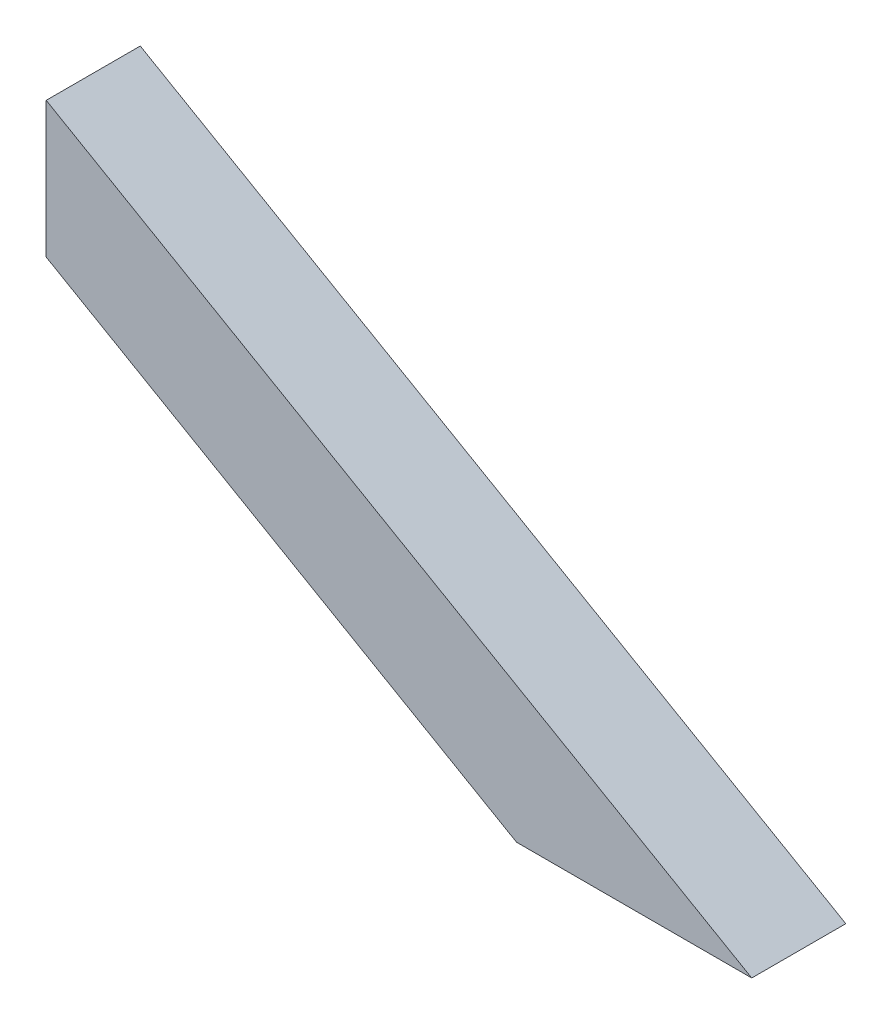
ISO-10303-21;
HEADER;
FILE_DESCRIPTION(('STEP AP214'),'2;1');
FILE_NAME('part.step','',(''),(''),'','','');
FILE_SCHEMA(('AUTOMOTIVE_DESIGN { 1 0 10303 214 1 1 1 1 }'));
ENDSEC;
DATA;
#1=APPLICATION_CONTEXT('core data for automotive mechanical design processes');
#2=APPLICATION_PROTOCOL_DEFINITION('international standard','automotive_design',2000,#1);
#3=PRODUCT_CONTEXT('',#1,'mechanical');
#4=PRODUCT('Part','Part','',(#3));
#5=PRODUCT_RELATED_PRODUCT_CATEGORY('part','',(#4));
#6=PRODUCT_DEFINITION_FORMATION('','',#4);
#7=PRODUCT_DEFINITION_CONTEXT('part definition',#1,'design');
#8=PRODUCT_DEFINITION('design','',#6,#7);
#9=PRODUCT_DEFINITION_SHAPE('','',#8);
#10=(LENGTH_UNIT() NAMED_UNIT(*) SI_UNIT(.MILLI.,.METRE.));
#11=(NAMED_UNIT(*) PLANE_ANGLE_UNIT() SI_UNIT($,.RADIAN.));
#12=(NAMED_UNIT(*) SI_UNIT($,.STERADIAN.) SOLID_ANGLE_UNIT());
#13=UNCERTAINTY_MEASURE_WITH_UNIT(LENGTH_MEASURE(1.E-05),#10,'distance_accuracy_value','');
#14=(GEOMETRIC_REPRESENTATION_CONTEXT(3) GLOBAL_UNCERTAINTY_ASSIGNED_CONTEXT((#13)) GLOBAL_UNIT_ASSIGNED_CONTEXT((#10,
#11,#12)) REPRESENTATION_CONTEXT('',''));
#15=CARTESIAN_POINT('',(0.,0.,0.));
#16=DIRECTION('',(0.,0.,1.));
#17=DIRECTION('',(1.,0.,0.));
#18=AXIS2_PLACEMENT_3D('',#15,#16,#17);
#19=CARTESIAN_POINT('',(100.,0.,20.));
#20=DIRECTION('',(0.500000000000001,0.866025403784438,0.));
#21=DIRECTION('',(-0.866025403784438,0.500000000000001,0.));
#22=AXIS2_PLACEMENT_3D('',#19,#20,#21);
#23=PLANE('',#22);
#24=DIRECTION('',(0.866025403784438,-0.500000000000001,0.));
#25=VECTOR('',#24,1.);
#26=CARTESIAN_POINT('',(100.,0.,0.));
#27=LINE('',#26,#25);
#28=CARTESIAN_POINT('',(0.,57.7350269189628,0.));
#29=VERTEX_POINT('',#28);
#30=CARTESIAN_POINT('',(100.,0.,0.));
#31=VERTEX_POINT('',#30);
#32=EDGE_CURVE('E101',#29,#31,#27,.T.);
#33=ORIENTED_EDGE('',*,*,#32,.T.);
#34=DIRECTION('',(0.,0.,-1.));
#35=VECTOR('',#34,1.);
#36=CARTESIAN_POINT('',(100.,0.,20.));
#37=LINE('',#36,#35);
#38=CARTESIAN_POINT('',(100.,0.,20.));
#39=VERTEX_POINT('',#38);
#40=EDGE_CURVE('E11',#39,#31,#37,.T.);
#41=ORIENTED_EDGE('',*,*,#40,.F.);
#42=DIRECTION('',(0.866025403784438,-0.500000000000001,0.));
#43=VECTOR('',#42,1.);
#44=CARTESIAN_POINT('',(100.,0.,20.));
#45=LINE('',#44,#43);
#46=CARTESIAN_POINT('',(0.,57.7350269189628,20.));
#47=VERTEX_POINT('',#46);
#48=EDGE_CURVE('E89',#47,#39,#45,.T.);
#49=ORIENTED_EDGE('',*,*,#48,.F.);
#50=DIRECTION('',(0.,0.,-1.));
#51=VECTOR('',#50,1.);
#52=CARTESIAN_POINT('',(0.,57.7350269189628,20.));
#53=LINE('',#52,#51);
#54=EDGE_CURVE('E97',#47,#29,#53,.T.);
#55=ORIENTED_EDGE('',*,*,#54,.T.);
#56=EDGE_LOOP('',(#33,#41,#49,#55));
#57=FACE_BOUND('',#56,.T.);
#58=ADVANCED_FACE('F38',(#57),#23,.F.);
#59=CARTESIAN_POINT('',(150.,0.,20.));
#60=DIRECTION('',(0.,1.,0.));
#61=DIRECTION('',(-1.,0.,0.));
#62=AXIS2_PLACEMENT_3D('',#59,#60,#61);
#63=PLANE('',#62);
#64=DIRECTION('',(1.,0.,0.));
#65=VECTOR('',#64,1.);
#66=CARTESIAN_POINT('',(150.,0.,0.));
#67=LINE('',#66,#65);
#68=CARTESIAN_POINT('',(150.,0.,0.));
#69=VERTEX_POINT('',#68);
#70=EDGE_CURVE('E93',#31,#69,#67,.T.);
#71=ORIENTED_EDGE('',*,*,#70,.T.);
#72=DIRECTION('',(0.,0.,-1.));
#73=VECTOR('',#72,1.);
#74=CARTESIAN_POINT('',(150.,0.,20.));
#75=LINE('',#74,#73);
#76=CARTESIAN_POINT('',(150.,0.,20.));
#77=VERTEX_POINT('',#76);
#78=EDGE_CURVE('E46',#77,#69,#75,.T.);
#79=ORIENTED_EDGE('',*,*,#78,.F.);
#80=DIRECTION('',(1.,0.,0.));
#81=VECTOR('',#80,1.);
#82=CARTESIAN_POINT('',(150.,0.,20.));
#83=LINE('',#82,#81);
#84=EDGE_CURVE('E84',#39,#77,#83,.T.);
#85=ORIENTED_EDGE('',*,*,#84,.F.);
#86=ORIENTED_EDGE('',*,*,#40,.T.);
#87=EDGE_LOOP('',(#71,#79,#85,#86));
#88=FACE_BOUND('',#87,.T.);
#89=ADVANCED_FACE('F92',(#88),#63,.F.);
#90=CARTESIAN_POINT('',(0.,86.602540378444,20.));
#91=DIRECTION('',(-0.500000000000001,-0.866025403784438,0.));
#92=DIRECTION('',(0.866025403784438,-0.500000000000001,0.));
#93=AXIS2_PLACEMENT_3D('',#90,#91,#92);
#94=PLANE('',#93);
#95=DIRECTION('',(-0.866025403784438,0.500000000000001,0.));
#96=VECTOR('',#95,1.);
#97=CARTESIAN_POINT('',(0.,86.602540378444,0.));
#98=LINE('',#97,#96);
#99=CARTESIAN_POINT('',(0.,86.602540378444,0.));
#100=VERTEX_POINT('',#99);
#101=EDGE_CURVE('E71',#69,#100,#98,.T.);
#102=ORIENTED_EDGE('',*,*,#101,.T.);
#103=DIRECTION('',(0.,0.,-1.));
#104=VECTOR('',#103,1.);
#105=CARTESIAN_POINT('',(0.,86.602540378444,20.));
#106=LINE('',#105,#104);
#107=CARTESIAN_POINT('',(0.,86.602540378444,20.));
#108=VERTEX_POINT('',#107);
#109=EDGE_CURVE('E94',#108,#100,#106,.T.);
#110=ORIENTED_EDGE('',*,*,#109,.F.);
#111=DIRECTION('',(-0.866025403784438,0.500000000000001,0.));
#112=VECTOR('',#111,1.);
#113=CARTESIAN_POINT('',(0.,86.602540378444,20.));
#114=LINE('',#113,#112);
#115=EDGE_CURVE('E87',#77,#108,#114,.T.);
#116=ORIENTED_EDGE('',*,*,#115,.F.);
#117=ORIENTED_EDGE('',*,*,#78,.T.);
#118=EDGE_LOOP('',(#102,#110,#116,#117));
#119=FACE_BOUND('',#118,.T.);
#120=ADVANCED_FACE('F95',(#119),#94,.F.);
#121=CARTESIAN_POINT('',(0.,57.7350269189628,20.));
#122=DIRECTION('',(1.,0.,0.));
#123=DIRECTION('',(0.,1.,0.));
#124=AXIS2_PLACEMENT_3D('',#121,#122,#123);
#125=PLANE('',#124);
#126=DIRECTION('',(0.,-1.,0.));
#127=VECTOR('',#126,1.);
#128=CARTESIAN_POINT('',(0.,57.7350269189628,0.));
#129=LINE('',#128,#127);
#130=EDGE_CURVE('E77',#100,#29,#129,.T.);
#131=ORIENTED_EDGE('',*,*,#130,.T.);
#132=ORIENTED_EDGE('',*,*,#54,.F.);
#133=DIRECTION('',(0.,-1.,0.));
#134=VECTOR('',#133,1.);
#135=CARTESIAN_POINT('',(0.,57.7350269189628,20.));
#136=LINE('',#135,#134);
#137=EDGE_CURVE('E54',#108,#47,#136,.T.);
#138=ORIENTED_EDGE('',*,*,#137,.F.);
#139=ORIENTED_EDGE('',*,*,#109,.T.);
#140=EDGE_LOOP('',(#131,#132,#138,#139));
#141=FACE_BOUND('',#140,.T.);
#142=ADVANCED_FACE('F108',(#141),#125,.F.);
#143=CARTESIAN_POINT('',(0.,57.7350269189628,20.));
#144=DIRECTION('',(0.,0.,-1.));
#145=DIRECTION('',(-1.,0.,0.));
#146=AXIS2_PLACEMENT_3D('',#143,#144,#145);
#147=PLANE('',#146);
#148=ORIENTED_EDGE('',*,*,#48,.T.);
#149=ORIENTED_EDGE('',*,*,#84,.T.);
#150=ORIENTED_EDGE('',*,*,#115,.T.);
#151=ORIENTED_EDGE('',*,*,#137,.T.);
#152=EDGE_LOOP('',(#148,#149,#150,#151));
#153=FACE_BOUND('',#152,.T.);
#154=ADVANCED_FACE('F85',(#153),#147,.F.);
#155=CARTESIAN_POINT('',(0.,57.7350269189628,0.));
#156=DIRECTION('',(0.,0.,-1.));
#157=DIRECTION('',(-1.,0.,0.));
#158=AXIS2_PLACEMENT_3D('',#155,#156,#157);
#159=PLANE('',#158);
#160=ORIENTED_EDGE('',*,*,#32,.F.);
#161=ORIENTED_EDGE('',*,*,#130,.F.);
#162=ORIENTED_EDGE('',*,*,#101,.F.);
#163=ORIENTED_EDGE('',*,*,#70,.F.);
#164=EDGE_LOOP('',(#160,#161,#162,#163));
#165=FACE_BOUND('',#164,.T.);
#166=ADVANCED_FACE('F111',(#165),#159,.T.);
#167=CLOSED_SHELL('',(#58,#89,#120,#142,#154,#166));
#168=MANIFOLD_SOLID_BREP('B2',#167);
#169=ADVANCED_BREP_SHAPE_REPRESENTATION('',(#18,#168),#14);
#170=SHAPE_DEFINITION_REPRESENTATION(#9,#169);
ENDSEC;
END-ISO-10303-21;
